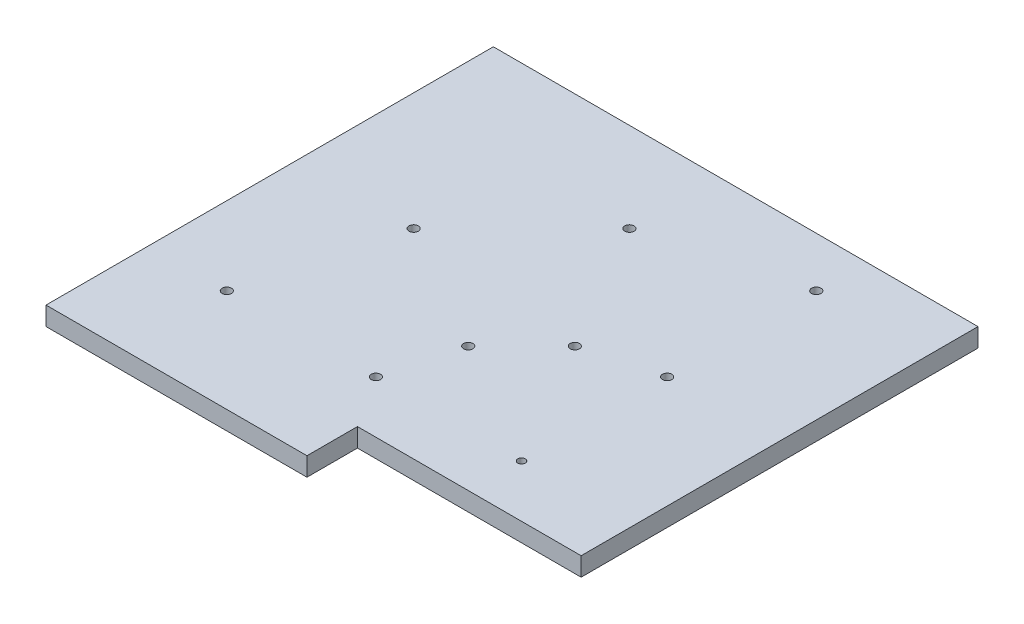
ISO-10303-21;
HEADER;
FILE_DESCRIPTION(('STEP AP214'),'2;1');
FILE_NAME('part.step','',(''),(''),'','','');
FILE_SCHEMA(('AUTOMOTIVE_DESIGN { 1 0 10303 214 1 1 1 1 }'));
ENDSEC;
DATA;
#1=APPLICATION_CONTEXT('core data for automotive mechanical design processes');
#2=APPLICATION_PROTOCOL_DEFINITION('international standard','automotive_design',2000,#1);
#3=PRODUCT_CONTEXT('',#1,'mechanical');
#4=PRODUCT('Part','Part','',(#3));
#5=PRODUCT_RELATED_PRODUCT_CATEGORY('part','',(#4));
#6=PRODUCT_DEFINITION_FORMATION('','',#4);
#7=PRODUCT_DEFINITION_CONTEXT('part definition',#1,'design');
#8=PRODUCT_DEFINITION('design','',#6,#7);
#9=PRODUCT_DEFINITION_SHAPE('','',#8);
#10=(LENGTH_UNIT() NAMED_UNIT(*) SI_UNIT(.MILLI.,.METRE.));
#11=(NAMED_UNIT(*) PLANE_ANGLE_UNIT() SI_UNIT($,.RADIAN.));
#12=(NAMED_UNIT(*) SI_UNIT($,.STERADIAN.) SOLID_ANGLE_UNIT());
#13=UNCERTAINTY_MEASURE_WITH_UNIT(LENGTH_MEASURE(1.E-05),#10,'distance_accuracy_value','');
#14=(GEOMETRIC_REPRESENTATION_CONTEXT(3) GLOBAL_UNCERTAINTY_ASSIGNED_CONTEXT((#13)) GLOBAL_UNIT_ASSIGNED_CONTEXT((#10,
#11,#12)) REPRESENTATION_CONTEXT('',''));
#15=CARTESIAN_POINT('',(0.,0.,0.));
#16=DIRECTION('',(0.,0.,1.));
#17=DIRECTION('',(1.,0.,0.));
#18=AXIS2_PLACEMENT_3D('',#15,#16,#17);
#19=CARTESIAN_POINT('',(0.,12.7,0.));
#20=DIRECTION('',(1.,0.,0.));
#21=DIRECTION('',(0.,0.,-1.));
#22=AXIS2_PLACEMENT_3D('',#19,#20,#21);
#23=PLANE('',#22);
#24=DIRECTION('',(0.,0.,1.));
#25=VECTOR('',#24,1.);
#26=CARTESIAN_POINT('',(0.,0.,0.));
#27=LINE('',#26,#25);
#28=CARTESIAN_POINT('',(0.,0.,-304.8));
#29=VERTEX_POINT('',#28);
#30=CARTESIAN_POINT('',(0.,0.,0.));
#31=VERTEX_POINT('',#30);
#32=EDGE_CURVE('E112',#29,#31,#27,.T.);
#33=ORIENTED_EDGE('',*,*,#32,.T.);
#34=DIRECTION('',(0.,-1.,0.));
#35=VECTOR('',#34,1.);
#36=CARTESIAN_POINT('',(0.,12.7,0.));
#37=LINE('',#36,#35);
#38=CARTESIAN_POINT('',(0.,12.7,0.));
#39=VERTEX_POINT('',#38);
#40=EDGE_CURVE('E11',#39,#31,#37,.T.);
#41=ORIENTED_EDGE('',*,*,#40,.F.);
#42=DIRECTION('',(0.,0.,1.));
#43=VECTOR('',#42,1.);
#44=CARTESIAN_POINT('',(0.,12.7,0.));
#45=LINE('',#44,#43);
#46=CARTESIAN_POINT('',(0.,12.7,-304.8));
#47=VERTEX_POINT('',#46);
#48=EDGE_CURVE('E120',#47,#39,#45,.T.);
#49=ORIENTED_EDGE('',*,*,#48,.F.);
#50=DIRECTION('',(0.,-1.,0.));
#51=VECTOR('',#50,1.);
#52=CARTESIAN_POINT('',(0.,12.7,-304.8));
#53=LINE('',#52,#51);
#54=EDGE_CURVE('E121',#47,#29,#53,.T.);
#55=ORIENTED_EDGE('',*,*,#54,.T.);
#56=EDGE_LOOP('',(#33,#41,#49,#55));
#57=FACE_BOUND('',#56,.T.);
#58=ADVANCED_FACE('F32',(#57),#23,.F.);
#59=CARTESIAN_POINT('',(0.,12.7,0.));
#60=DIRECTION('',(0.,0.,-1.));
#61=DIRECTION('',(-1.,0.,0.));
#62=AXIS2_PLACEMENT_3D('',#59,#60,#61);
#63=PLANE('',#62);
#64=DIRECTION('',(1.,0.,0.));
#65=VECTOR('',#64,1.);
#66=CARTESIAN_POINT('',(0.,0.,0.));
#67=LINE('',#66,#65);
#68=CARTESIAN_POINT('',(177.8,0.,0.));
#69=VERTEX_POINT('',#68);
#70=EDGE_CURVE('E104',#31,#69,#67,.T.);
#71=ORIENTED_EDGE('',*,*,#70,.T.);
#72=DIRECTION('',(0.,1.,0.));
#73=VECTOR('',#72,1.);
#74=CARTESIAN_POINT('',(177.8,0.,0.));
#75=LINE('',#74,#73);
#76=CARTESIAN_POINT('',(177.8,12.7,0.));
#77=VERTEX_POINT('',#76);
#78=EDGE_CURVE('E92',#69,#77,#75,.T.);
#79=ORIENTED_EDGE('',*,*,#78,.T.);
#80=DIRECTION('',(1.,0.,0.));
#81=VECTOR('',#80,1.);
#82=CARTESIAN_POINT('',(0.,12.7,0.));
#83=LINE('',#82,#81);
#84=EDGE_CURVE('E79',#39,#77,#83,.T.);
#85=ORIENTED_EDGE('',*,*,#84,.F.);
#86=ORIENTED_EDGE('',*,*,#40,.T.);
#87=EDGE_LOOP('',(#71,#79,#85,#86));
#88=FACE_BOUND('',#87,.T.);
#89=ADVANCED_FACE('F108',(#88),#63,.F.);
#90=CARTESIAN_POINT('',(330.2,12.7,0.));
#91=DIRECTION('',(-1.,0.,0.));
#92=DIRECTION('',(0.,0.,1.));
#93=AXIS2_PLACEMENT_3D('',#90,#91,#92);
#94=PLANE('',#93);
#95=DIRECTION('',(0.,0.,-1.));
#96=VECTOR('',#95,1.);
#97=CARTESIAN_POINT('',(330.2,12.7,0.));
#98=LINE('',#97,#96);
#99=CARTESIAN_POINT('',(330.2,12.7,-34.4));
#100=VERTEX_POINT('',#99);
#101=CARTESIAN_POINT('',(330.2,12.7,-304.8));
#102=VERTEX_POINT('',#101);
#103=EDGE_CURVE('E130',#100,#102,#98,.T.);
#104=ORIENTED_EDGE('',*,*,#103,.F.);
#105=DIRECTION('',(0.,1.,0.));
#106=VECTOR('',#105,1.);
#107=CARTESIAN_POINT('',(330.2,0.,-34.4));
#108=LINE('',#107,#106);
#109=CARTESIAN_POINT('',(330.2,0.,-34.4));
#110=VERTEX_POINT('',#109);
#111=EDGE_CURVE('E97',#110,#100,#108,.T.);
#112=ORIENTED_EDGE('',*,*,#111,.F.);
#113=DIRECTION('',(0.,0.,-1.));
#114=VECTOR('',#113,1.);
#115=CARTESIAN_POINT('',(330.2,0.,0.));
#116=LINE('',#115,#114);
#117=CARTESIAN_POINT('',(330.2,0.,-304.8));
#118=VERTEX_POINT('',#117);
#119=EDGE_CURVE('E111',#110,#118,#116,.T.);
#120=ORIENTED_EDGE('',*,*,#119,.T.);
#121=DIRECTION('',(0.,-1.,0.));
#122=VECTOR('',#121,1.);
#123=CARTESIAN_POINT('',(330.2,12.7,-304.8));
#124=LINE('',#123,#122);
#125=EDGE_CURVE('E40',#102,#118,#124,.T.);
#126=ORIENTED_EDGE('',*,*,#125,.F.);
#127=EDGE_LOOP('',(#104,#112,#120,#126));
#128=FACE_BOUND('',#127,.T.);
#129=ADVANCED_FACE('F138',(#128),#94,.F.);
#130=CARTESIAN_POINT('',(0.,12.7,-304.8));
#131=DIRECTION('',(0.,0.,1.));
#132=DIRECTION('',(1.,0.,0.));
#133=AXIS2_PLACEMENT_3D('',#130,#131,#132);
#134=PLANE('',#133);
#135=DIRECTION('',(-1.,0.,0.));
#136=VECTOR('',#135,1.);
#137=CARTESIAN_POINT('',(0.,0.,-304.8));
#138=LINE('',#137,#136);
#139=EDGE_CURVE('E73',#118,#29,#138,.T.);
#140=ORIENTED_EDGE('',*,*,#139,.T.);
#141=ORIENTED_EDGE('',*,*,#54,.F.);
#142=DIRECTION('',(-1.,0.,0.));
#143=VECTOR('',#142,1.);
#144=CARTESIAN_POINT('',(0.,12.7,-304.8));
#145=LINE('',#144,#143);
#146=EDGE_CURVE('E56',#102,#47,#145,.T.);
#147=ORIENTED_EDGE('',*,*,#146,.F.);
#148=ORIENTED_EDGE('',*,*,#125,.T.);
#149=EDGE_LOOP('',(#140,#141,#147,#148));
#150=FACE_BOUND('',#149,.T.);
#151=ADVANCED_FACE('F124',(#150),#134,.F.);
#152=CARTESIAN_POINT('',(0.,12.7,0.));
#153=DIRECTION('',(0.,-1.,0.));
#154=DIRECTION('',(0.,0.,-1.));
#155=AXIS2_PLACEMENT_3D('',#152,#153,#154);
#156=PLANE('',#155);
#157=CARTESIAN_POINT('',(154.8,12.7,-69.9999999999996));
#158=DIRECTION('',(0.,1.,0.));
#159=DIRECTION('',(0.,0.,1.));
#160=AXIS2_PLACEMENT_3D('',#157,#158,#159);
#161=CIRCLE('',#160,3.17499999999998);
#162=CARTESIAN_POINT('',(154.8,12.7,-66.8249999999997));
#163=VERTEX_POINT('',#162);
#164=EDGE_CURVE('E193',#163,#163,#161,.T.);
#165=ORIENTED_EDGE('',*,*,#164,.F.);
#166=EDGE_LOOP('',(#165));
#167=FACE_BOUND('',#166,.T.);
#168=CARTESIAN_POINT('',(53.2,12.7,-69.9999999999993));
#169=DIRECTION('',(0.,1.,0.));
#170=DIRECTION('',(0.,0.,1.));
#171=AXIS2_PLACEMENT_3D('',#168,#169,#170);
#172=CIRCLE('',#171,3.175);
#173=CARTESIAN_POINT('',(53.2,12.7,-66.8249999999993));
#174=VERTEX_POINT('',#173);
#175=EDGE_CURVE('E187',#174,#174,#172,.T.);
#176=ORIENTED_EDGE('',*,*,#175,.F.);
#177=EDGE_LOOP('',(#176));
#178=FACE_BOUND('',#177,.T.);
#179=CARTESIAN_POINT('',(168.090279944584,12.7,-119.6));
#180=DIRECTION('',(0.,1.,0.));
#181=DIRECTION('',(0.,0.,1.));
#182=AXIS2_PLACEMENT_3D('',#179,#180,#181);
#183=CIRCLE('',#182,3.17499999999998);
#184=CARTESIAN_POINT('',(168.090279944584,12.7,-116.425));
#185=VERTEX_POINT('',#184);
#186=EDGE_CURVE('E181',#185,#185,#183,.T.);
#187=ORIENTED_EDGE('',*,*,#186,.F.);
#188=EDGE_LOOP('',(#187));
#189=FACE_BOUND('',#188,.T.);
#190=CARTESIAN_POINT('',(80.1020989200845,12.7,-170.4));
#191=DIRECTION('',(0.,1.,0.));
#192=DIRECTION('',(0.,0.,1.));
#193=AXIS2_PLACEMENT_3D('',#190,#191,#192);
#194=CIRCLE('',#193,3.175);
#195=CARTESIAN_POINT('',(80.1020989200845,12.7,-167.225));
#196=VERTEX_POINT('',#195);
#197=EDGE_CURVE('E175',#196,#196,#194,.T.);
#198=ORIENTED_EDGE('',*,*,#197,.F.);
#199=EDGE_LOOP('',(#198));
#200=FACE_BOUND('',#199,.T.);
#201=CARTESIAN_POINT('',(204.4,12.7,-155.909720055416));
#202=DIRECTION('',(0.,1.,0.));
#203=DIRECTION('',(0.,0.,1.));
#204=AXIS2_PLACEMENT_3D('',#201,#202,#203);
#205=CIRCLE('',#204,3.17499999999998);
#206=CARTESIAN_POINT('',(204.4,12.7,-152.734720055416));
#207=VERTEX_POINT('',#206);
#208=EDGE_CURVE('E169',#207,#207,#205,.T.);
#209=ORIENTED_EDGE('',*,*,#208,.F.);
#210=EDGE_LOOP('',(#209));
#211=FACE_BOUND('',#210,.T.);
#212=CARTESIAN_POINT('',(153.6,12.7,-243.897901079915));
#213=DIRECTION('',(0.,1.,0.));
#214=DIRECTION('',(0.,0.,1.));
#215=AXIS2_PLACEMENT_3D('',#212,#213,#214);
#216=CIRCLE('',#215,3.17499999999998);
#217=CARTESIAN_POINT('',(153.6,12.7,-240.722901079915));
#218=VERTEX_POINT('',#217);
#219=EDGE_CURVE('E163',#218,#218,#216,.T.);
#220=ORIENTED_EDGE('',*,*,#219,.F.);
#221=EDGE_LOOP('',(#220));
#222=FACE_BOUND('',#221,.T.);
#223=CARTESIAN_POINT('',(254.,12.7,-169.2));
#224=DIRECTION('',(0.,1.,0.));
#225=DIRECTION('',(0.,0.,1.));
#226=AXIS2_PLACEMENT_3D('',#223,#224,#225);
#227=CIRCLE('',#226,3.17499999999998);
#228=CARTESIAN_POINT('',(254.,12.7,-166.025));
#229=VERTEX_POINT('',#228);
#230=EDGE_CURVE('E157',#229,#229,#227,.T.);
#231=ORIENTED_EDGE('',*,*,#230,.F.);
#232=EDGE_LOOP('',(#231));
#233=FACE_BOUND('',#232,.T.);
#234=CARTESIAN_POINT('',(254.,12.7,-270.8));
#235=DIRECTION('',(0.,1.,0.));
#236=DIRECTION('',(0.,0.,1.));
#237=AXIS2_PLACEMENT_3D('',#234,#235,#236);
#238=CIRCLE('',#237,3.17499999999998);
#239=CARTESIAN_POINT('',(254.,12.7,-267.625));
#240=VERTEX_POINT('',#239);
#241=EDGE_CURVE('E154',#240,#240,#238,.T.);
#242=ORIENTED_EDGE('',*,*,#241,.F.);
#243=EDGE_LOOP('',(#242));
#244=FACE_BOUND('',#243,.T.);
#245=CARTESIAN_POINT('',(254.,12.7,-70.));
#246=DIRECTION('',(0.,1.,0.));
#247=DIRECTION('',(0.,0.,1.));
#248=AXIS2_PLACEMENT_3D('',#245,#246,#247);
#249=CIRCLE('',#248,2.55269999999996);
#250=CARTESIAN_POINT('',(254.,12.7,-67.4473000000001));
#251=VERTEX_POINT('',#250);
#252=EDGE_CURVE('E148',#251,#251,#249,.T.);
#253=ORIENTED_EDGE('',*,*,#252,.F.);
#254=EDGE_LOOP('',(#253));
#255=FACE_BOUND('',#254,.T.);
#256=ORIENTED_EDGE('',*,*,#84,.T.);
#257=DIRECTION('',(0.,0.,1.));
#258=VECTOR('',#257,1.);
#259=CARTESIAN_POINT('',(177.8,12.7,0.));
#260=LINE('',#259,#258);
#261=CARTESIAN_POINT('',(177.8,12.7,-34.4));
#262=VERTEX_POINT('',#261);
#263=EDGE_CURVE('E95',#262,#77,#260,.T.);
#264=ORIENTED_EDGE('',*,*,#263,.F.);
#265=DIRECTION('',(-1.,0.,0.));
#266=VECTOR('',#265,1.);
#267=CARTESIAN_POINT('',(177.8,12.7,-34.4));
#268=LINE('',#267,#266);
#269=EDGE_CURVE('E106',#100,#262,#268,.T.);
#270=ORIENTED_EDGE('',*,*,#269,.F.);
#271=ORIENTED_EDGE('',*,*,#103,.T.);
#272=ORIENTED_EDGE('',*,*,#146,.T.);
#273=ORIENTED_EDGE('',*,*,#48,.T.);
#274=EDGE_LOOP('',(#256,#264,#270,#271,#272,#273));
#275=FACE_BOUND('',#274,.T.);
#276=ADVANCED_FACE('F135',(#167,#178,#189,#200,#211,#222,#233,#244,#255,#275),#156,.F.);
#277=CARTESIAN_POINT('',(0.,0.,0.));
#278=DIRECTION('',(0.,-1.,0.));
#279=DIRECTION('',(0.,0.,-1.));
#280=AXIS2_PLACEMENT_3D('',#277,#278,#279);
#281=PLANE('',#280);
#282=CARTESIAN_POINT('',(154.8,0.,-69.9999999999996));
#283=DIRECTION('',(0.,-1.,0.));
#284=DIRECTION('',(0.,0.,-1.));
#285=AXIS2_PLACEMENT_3D('',#282,#283,#284);
#286=CIRCLE('',#285,3.17499999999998);
#287=CARTESIAN_POINT('',(154.8,0.,-73.1749999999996));
#288=VERTEX_POINT('',#287);
#289=EDGE_CURVE('E190',#288,#288,#286,.T.);
#290=ORIENTED_EDGE('',*,*,#289,.F.);
#291=EDGE_LOOP('',(#290));
#292=FACE_BOUND('',#291,.T.);
#293=CARTESIAN_POINT('',(53.2,0.,-69.9999999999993));
#294=DIRECTION('',(0.,-1.,0.));
#295=DIRECTION('',(0.,0.,-1.));
#296=AXIS2_PLACEMENT_3D('',#293,#294,#295);
#297=CIRCLE('',#296,3.17499999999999);
#298=CARTESIAN_POINT('',(53.2,0.,-73.1749999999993));
#299=VERTEX_POINT('',#298);
#300=EDGE_CURVE('E184',#299,#299,#297,.T.);
#301=ORIENTED_EDGE('',*,*,#300,.F.);
#302=EDGE_LOOP('',(#301));
#303=FACE_BOUND('',#302,.T.);
#304=CARTESIAN_POINT('',(168.090279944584,0.,-119.6));
#305=DIRECTION('',(0.,-1.,0.));
#306=DIRECTION('',(0.,0.,-1.));
#307=AXIS2_PLACEMENT_3D('',#304,#305,#306);
#308=CIRCLE('',#307,3.17499999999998);
#309=CARTESIAN_POINT('',(168.090279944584,0.,-122.775));
#310=VERTEX_POINT('',#309);
#311=EDGE_CURVE('E178',#310,#310,#308,.T.);
#312=ORIENTED_EDGE('',*,*,#311,.F.);
#313=EDGE_LOOP('',(#312));
#314=FACE_BOUND('',#313,.T.);
#315=CARTESIAN_POINT('',(80.1020989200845,0.,-170.4));
#316=DIRECTION('',(0.,-1.,0.));
#317=DIRECTION('',(0.,0.,-1.));
#318=AXIS2_PLACEMENT_3D('',#315,#316,#317);
#319=CIRCLE('',#318,3.17499999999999);
#320=CARTESIAN_POINT('',(80.1020989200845,0.,-173.575));
#321=VERTEX_POINT('',#320);
#322=EDGE_CURVE('E172',#321,#321,#319,.T.);
#323=ORIENTED_EDGE('',*,*,#322,.F.);
#324=EDGE_LOOP('',(#323));
#325=FACE_BOUND('',#324,.T.);
#326=CARTESIAN_POINT('',(204.4,0.,-155.909720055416));
#327=DIRECTION('',(0.,-1.,0.));
#328=DIRECTION('',(0.,0.,-1.));
#329=AXIS2_PLACEMENT_3D('',#326,#327,#328);
#330=CIRCLE('',#329,3.17499999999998);
#331=CARTESIAN_POINT('',(204.4,0.,-159.084720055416));
#332=VERTEX_POINT('',#331);
#333=EDGE_CURVE('E166',#332,#332,#330,.T.);
#334=ORIENTED_EDGE('',*,*,#333,.F.);
#335=EDGE_LOOP('',(#334));
#336=FACE_BOUND('',#335,.T.);
#337=CARTESIAN_POINT('',(153.6,0.,-243.897901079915));
#338=DIRECTION('',(0.,-1.,0.));
#339=DIRECTION('',(0.,0.,-1.));
#340=AXIS2_PLACEMENT_3D('',#337,#338,#339);
#341=CIRCLE('',#340,3.17499999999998);
#342=CARTESIAN_POINT('',(153.6,0.,-247.072901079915));
#343=VERTEX_POINT('',#342);
#344=EDGE_CURVE('E160',#343,#343,#341,.T.);
#345=ORIENTED_EDGE('',*,*,#344,.F.);
#346=EDGE_LOOP('',(#345));
#347=FACE_BOUND('',#346,.T.);
#348=CARTESIAN_POINT('',(254.,0.,-169.2));
#349=DIRECTION('',(0.,-1.,0.));
#350=DIRECTION('',(0.,0.,-1.));
#351=AXIS2_PLACEMENT_3D('',#348,#349,#350);
#352=CIRCLE('',#351,3.17499999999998);
#353=CARTESIAN_POINT('',(254.,0.,-172.375));
#354=VERTEX_POINT('',#353);
#355=EDGE_CURVE('E35',#354,#354,#352,.T.);
#356=ORIENTED_EDGE('',*,*,#355,.F.);
#357=EDGE_LOOP('',(#356));
#358=FACE_BOUND('',#357,.T.);
#359=CARTESIAN_POINT('',(254.,0.,-270.8));
#360=DIRECTION('',(0.,-1.,0.));
#361=DIRECTION('',(0.,0.,-1.));
#362=AXIS2_PLACEMENT_3D('',#359,#360,#361);
#363=CIRCLE('',#362,3.17499999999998);
#364=CARTESIAN_POINT('',(254.,0.,-273.975));
#365=VERTEX_POINT('',#364);
#366=EDGE_CURVE('E151',#365,#365,#363,.T.);
#367=ORIENTED_EDGE('',*,*,#366,.F.);
#368=EDGE_LOOP('',(#367));
#369=FACE_BOUND('',#368,.T.);
#370=CARTESIAN_POINT('',(254.,0.,-70.));
#371=DIRECTION('',(0.,-1.,0.));
#372=DIRECTION('',(0.,0.,-1.));
#373=AXIS2_PLACEMENT_3D('',#370,#371,#372);
#374=CIRCLE('',#373,2.55269999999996);
#375=CARTESIAN_POINT('',(254.,0.,-72.5527));
#376=VERTEX_POINT('',#375);
#377=EDGE_CURVE('E144',#376,#376,#374,.T.);
#378=ORIENTED_EDGE('',*,*,#377,.F.);
#379=EDGE_LOOP('',(#378));
#380=FACE_BOUND('',#379,.T.);
#381=DIRECTION('',(0.,0.,1.));
#382=VECTOR('',#381,1.);
#383=CARTESIAN_POINT('',(177.8,0.,0.));
#384=LINE('',#383,#382);
#385=CARTESIAN_POINT('',(177.8,0.,-34.4));
#386=VERTEX_POINT('',#385);
#387=EDGE_CURVE('E47',#386,#69,#384,.T.);
#388=ORIENTED_EDGE('',*,*,#387,.T.);
#389=ORIENTED_EDGE('',*,*,#70,.F.);
#390=ORIENTED_EDGE('',*,*,#32,.F.);
#391=ORIENTED_EDGE('',*,*,#139,.F.);
#392=ORIENTED_EDGE('',*,*,#119,.F.);
#393=DIRECTION('',(-1.,0.,0.));
#394=VECTOR('',#393,1.);
#395=CARTESIAN_POINT('',(177.8,0.,-34.4));
#396=LINE('',#395,#394);
#397=EDGE_CURVE('E98',#110,#386,#396,.T.);
#398=ORIENTED_EDGE('',*,*,#397,.T.);
#399=EDGE_LOOP('',(#388,#389,#390,#391,#392,#398));
#400=FACE_BOUND('',#399,.T.);
#401=ADVANCED_FACE('F102',(#292,#303,#314,#325,#336,#347,#358,#369,#380,#400),#281,.T.);
#402=CARTESIAN_POINT('',(177.8,0.,0.));
#403=DIRECTION('',(-1.,0.,0.));
#404=DIRECTION('',(0.,0.,1.));
#405=AXIS2_PLACEMENT_3D('',#402,#403,#404);
#406=PLANE('',#405);
#407=ORIENTED_EDGE('',*,*,#263,.T.);
#408=ORIENTED_EDGE('',*,*,#78,.F.);
#409=ORIENTED_EDGE('',*,*,#387,.F.);
#410=DIRECTION('',(0.,1.,0.));
#411=VECTOR('',#410,1.);
#412=CARTESIAN_POINT('',(177.8,0.,-34.4));
#413=LINE('',#412,#411);
#414=EDGE_CURVE('E115',#386,#262,#413,.T.);
#415=ORIENTED_EDGE('',*,*,#414,.T.);
#416=EDGE_LOOP('',(#407,#408,#409,#415));
#417=FACE_BOUND('',#416,.T.);
#418=ADVANCED_FACE('F93',(#417),#406,.F.);
#419=CARTESIAN_POINT('',(177.8,0.,-34.4));
#420=DIRECTION('',(0.,0.,-1.));
#421=DIRECTION('',(-1.,0.,0.));
#422=AXIS2_PLACEMENT_3D('',#419,#420,#421);
#423=PLANE('',#422);
#424=ORIENTED_EDGE('',*,*,#269,.T.);
#425=ORIENTED_EDGE('',*,*,#414,.F.);
#426=ORIENTED_EDGE('',*,*,#397,.F.);
#427=ORIENTED_EDGE('',*,*,#111,.T.);
#428=EDGE_LOOP('',(#424,#425,#426,#427));
#429=FACE_BOUND('',#428,.T.);
#430=ADVANCED_FACE('F221',(#429),#423,.F.);
#431=CARTESIAN_POINT('',(254.,12.7,-70.));
#432=DIRECTION('',(0.,1.,0.));
#433=DIRECTION('',(0.,0.,1.));
#434=AXIS2_PLACEMENT_3D('',#431,#432,#433);
#435=CYLINDRICAL_SURFACE('',#434,2.55269999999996);
#436=ORIENTED_EDGE('',*,*,#377,.T.);
#437=EDGE_LOOP('',(#436));
#438=FACE_BOUND('',#437,.T.);
#439=ORIENTED_EDGE('',*,*,#252,.T.);
#440=EDGE_LOOP('',(#439));
#441=FACE_BOUND('',#440,.T.);
#442=ADVANCED_FACE('F218',(#438,#441),#435,.F.);
#443=CARTESIAN_POINT('',(254.,12.7,-270.8));
#444=DIRECTION('',(0.,1.,0.));
#445=DIRECTION('',(0.,0.,1.));
#446=AXIS2_PLACEMENT_3D('',#443,#444,#445);
#447=CYLINDRICAL_SURFACE('',#446,3.17499999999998);
#448=ORIENTED_EDGE('',*,*,#366,.T.);
#449=EDGE_LOOP('',(#448));
#450=FACE_BOUND('',#449,.T.);
#451=ORIENTED_EDGE('',*,*,#241,.T.);
#452=EDGE_LOOP('',(#451));
#453=FACE_BOUND('',#452,.T.);
#454=ADVANCED_FACE('F220',(#450,#453),#447,.F.);
#455=CARTESIAN_POINT('',(254.,12.7,-169.2));
#456=DIRECTION('',(0.,1.,0.));
#457=DIRECTION('',(0.,0.,1.));
#458=AXIS2_PLACEMENT_3D('',#455,#456,#457);
#459=CYLINDRICAL_SURFACE('',#458,3.17499999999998);
#460=ORIENTED_EDGE('',*,*,#355,.T.);
#461=EDGE_LOOP('',(#460));
#462=FACE_BOUND('',#461,.T.);
#463=ORIENTED_EDGE('',*,*,#230,.T.);
#464=EDGE_LOOP('',(#463));
#465=FACE_BOUND('',#464,.T.);
#466=ADVANCED_FACE('F228',(#462,#465),#459,.F.);
#467=CARTESIAN_POINT('',(153.6,12.7,-243.897901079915));
#468=DIRECTION('',(0.,1.,0.));
#469=DIRECTION('',(0.,0.,1.));
#470=AXIS2_PLACEMENT_3D('',#467,#468,#469);
#471=CYLINDRICAL_SURFACE('',#470,3.17499999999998);
#472=ORIENTED_EDGE('',*,*,#344,.T.);
#473=EDGE_LOOP('',(#472));
#474=FACE_BOUND('',#473,.T.);
#475=ORIENTED_EDGE('',*,*,#219,.T.);
#476=EDGE_LOOP('',(#475));
#477=FACE_BOUND('',#476,.T.);
#478=ADVANCED_FACE('F275',(#474,#477),#471,.F.);
#479=CARTESIAN_POINT('',(204.4,12.7,-155.909720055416));
#480=DIRECTION('',(0.,1.,0.));
#481=DIRECTION('',(0.,0.,1.));
#482=AXIS2_PLACEMENT_3D('',#479,#480,#481);
#483=CYLINDRICAL_SURFACE('',#482,3.17499999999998);
#484=ORIENTED_EDGE('',*,*,#333,.T.);
#485=EDGE_LOOP('',(#484));
#486=FACE_BOUND('',#485,.T.);
#487=ORIENTED_EDGE('',*,*,#208,.T.);
#488=EDGE_LOOP('',(#487));
#489=FACE_BOUND('',#488,.T.);
#490=ADVANCED_FACE('F296',(#486,#489),#483,.F.);
#491=CARTESIAN_POINT('',(80.1020989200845,12.7,-170.4));
#492=DIRECTION('',(0.,1.,0.));
#493=DIRECTION('',(0.,0.,1.));
#494=AXIS2_PLACEMENT_3D('',#491,#492,#493);
#495=CYLINDRICAL_SURFACE('',#494,3.17499999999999);
#496=ORIENTED_EDGE('',*,*,#322,.T.);
#497=EDGE_LOOP('',(#496));
#498=FACE_BOUND('',#497,.T.);
#499=ORIENTED_EDGE('',*,*,#197,.T.);
#500=EDGE_LOOP('',(#499));
#501=FACE_BOUND('',#500,.T.);
#502=ADVANCED_FACE('F306',(#498,#501),#495,.F.);
#503=CARTESIAN_POINT('',(168.090279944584,12.7,-119.6));
#504=DIRECTION('',(0.,1.,0.));
#505=DIRECTION('',(0.,0.,1.));
#506=AXIS2_PLACEMENT_3D('',#503,#504,#505);
#507=CYLINDRICAL_SURFACE('',#506,3.17499999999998);
#508=ORIENTED_EDGE('',*,*,#311,.T.);
#509=EDGE_LOOP('',(#508));
#510=FACE_BOUND('',#509,.T.);
#511=ORIENTED_EDGE('',*,*,#186,.T.);
#512=EDGE_LOOP('',(#511));
#513=FACE_BOUND('',#512,.T.);
#514=ADVANCED_FACE('F316',(#510,#513),#507,.F.);
#515=CARTESIAN_POINT('',(53.2,12.7,-69.9999999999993));
#516=DIRECTION('',(0.,1.,0.));
#517=DIRECTION('',(0.,0.,1.));
#518=AXIS2_PLACEMENT_3D('',#515,#516,#517);
#519=CYLINDRICAL_SURFACE('',#518,3.17499999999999);
#520=ORIENTED_EDGE('',*,*,#300,.T.);
#521=EDGE_LOOP('',(#520));
#522=FACE_BOUND('',#521,.T.);
#523=ORIENTED_EDGE('',*,*,#175,.T.);
#524=EDGE_LOOP('',(#523));
#525=FACE_BOUND('',#524,.T.);
#526=ADVANCED_FACE('F326',(#522,#525),#519,.F.);
#527=CARTESIAN_POINT('',(154.8,12.7,-69.9999999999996));
#528=DIRECTION('',(0.,1.,0.));
#529=DIRECTION('',(0.,0.,1.));
#530=AXIS2_PLACEMENT_3D('',#527,#528,#529);
#531=CYLINDRICAL_SURFACE('',#530,3.17499999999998);
#532=ORIENTED_EDGE('',*,*,#289,.T.);
#533=EDGE_LOOP('',(#532));
#534=FACE_BOUND('',#533,.T.);
#535=ORIENTED_EDGE('',*,*,#164,.T.);
#536=EDGE_LOOP('',(#535));
#537=FACE_BOUND('',#536,.T.);
#538=ADVANCED_FACE('F197',(#534,#537),#531,.F.);
#539=CLOSED_SHELL('',(#58,#89,#129,#151,#276,#401,#418,#430,#442,#454,#466,#478,#490,#502,#514,
#526,#538));
#540=MANIFOLD_SOLID_BREP('B2',#539);
#541=ADVANCED_BREP_SHAPE_REPRESENTATION('',(#18,#540),#14);
#542=SHAPE_DEFINITION_REPRESENTATION(#9,#541);
ENDSEC;
END-ISO-10303-21;
